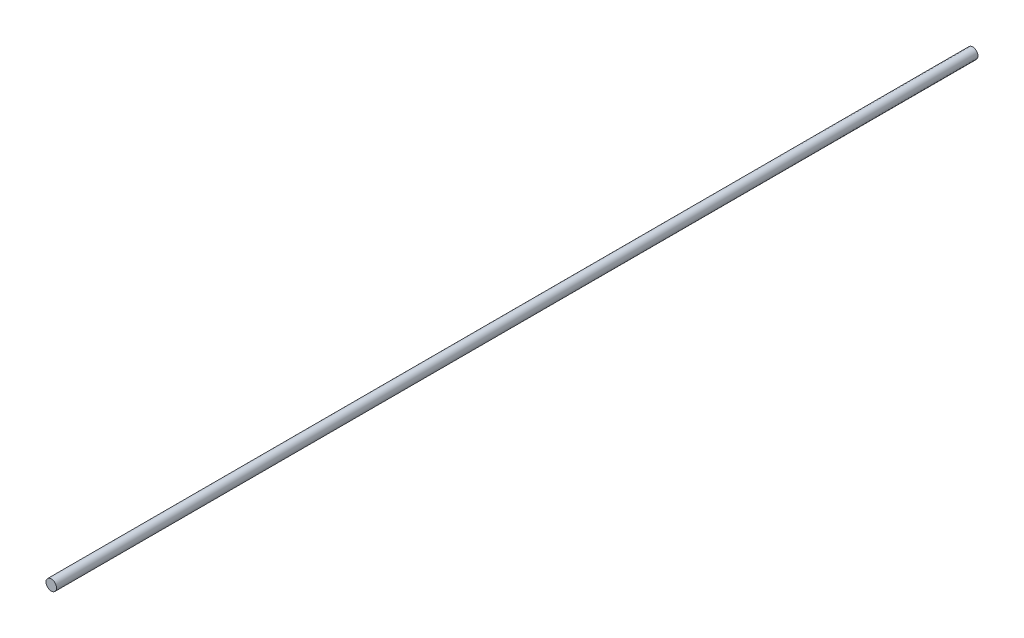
from build123d import *

# Parameters (mm, degrees)
SKETCH1_R           = 4
BOSS_EXTRUDE1_DEPTH = 700


with BuildPart() as part:
    # Sketch1 → Boss-Extrude1 (new body)
    with BuildSketch(Plane.XY):
        with Locations((-26.242325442, 13.77996587)):
            Circle(SKETCH1_R)
    extrude(amount=BOSS_EXTRUDE1_DEPTH)


solid = part.part
